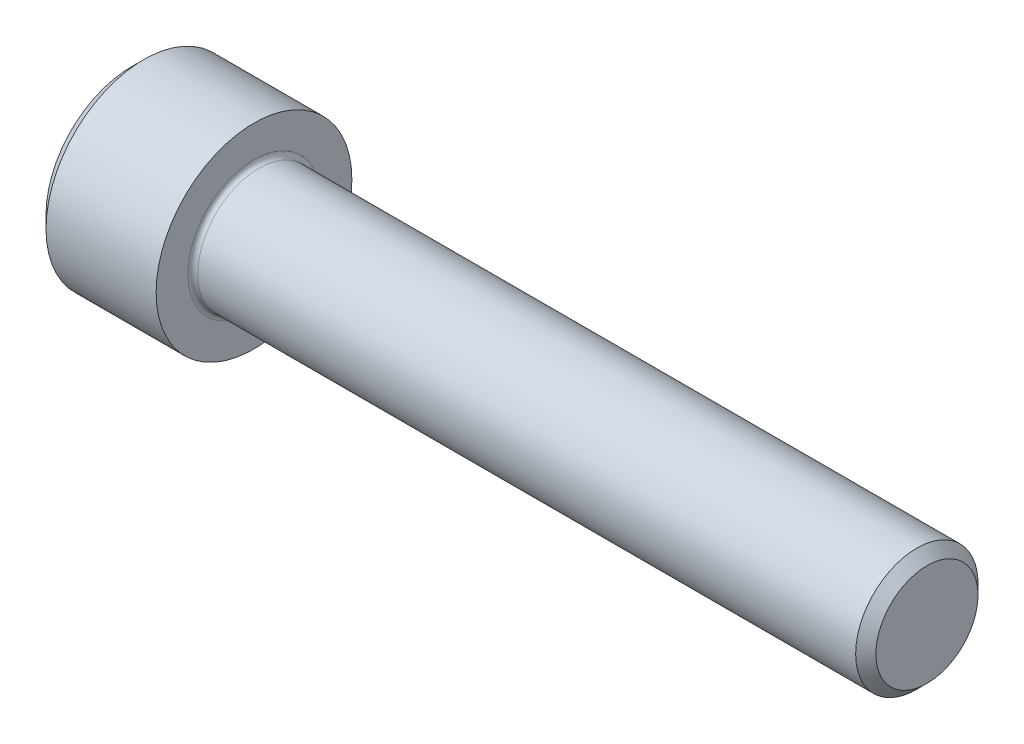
from build123d import *

# Parameters (mm, degrees)
FILLET1_R   = 0.4
HEX_2_DEPTH = 5


with BuildPart() as part:
    # BodySke → Base-Revolve (revolve)
    with BuildSketch(Plane.XY, mode=Mode.PRIVATE) as base_revolve_sk:
        Polygon((0, 0), (0, 7), (1, 8), (10, 8), (10, 5), (64.172, 5), (65, 4.172), (65, 0), align=None)
    revolve(base_revolve_sk.sketch.rotate(Axis((-31.75, 0, 0), (1, 0, 0)), 90), axis=Axis((-31.75, 0, 0), (1, 0, 0)))

    # Fillet1
    fillet1_edges = [part.edges().sort_by_distance(p)[0] for p in [
        (10, 0, -5),
    ]]
    fillet(fillet1_edges, radius=FILLET1_R)

    # Sketch2 → Hex-PreBroach (revolve, cut)
    with BuildSketch(Plane.XY, mode=Mode.PRIVATE) as hex_prebroach_sk:
        Polygon((0, 4.0575), (5, 4.0575), (7.342598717, 0), (0, 0), align=None)
    revolve(hex_prebroach_sk.sketch.rotate(Axis((0, 0, 0), (1, 0, 0)), 90), axis=Axis((0, 0, 0), (1, 0, 0)), mode=Mode.SUBTRACT)

    # Sketch3 → Hex 2 (cut)
    with BuildSketch(Plane(origin=(0, 0, 0), x_dir=(0, 0.500000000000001, 0.866025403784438), z_dir=(-1, 0, 0))):
        Polygon((2.342598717, 4.0575), (-2.342598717, 4.0575), (-4.685197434, 0), (-2.342598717, -4.0575), (2.342598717, -4.0575), (4.685197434, 0), align=None)
    extrude(amount=-HEX_2_DEPTH, mode=Mode.SUBTRACT)


solid = part.part
